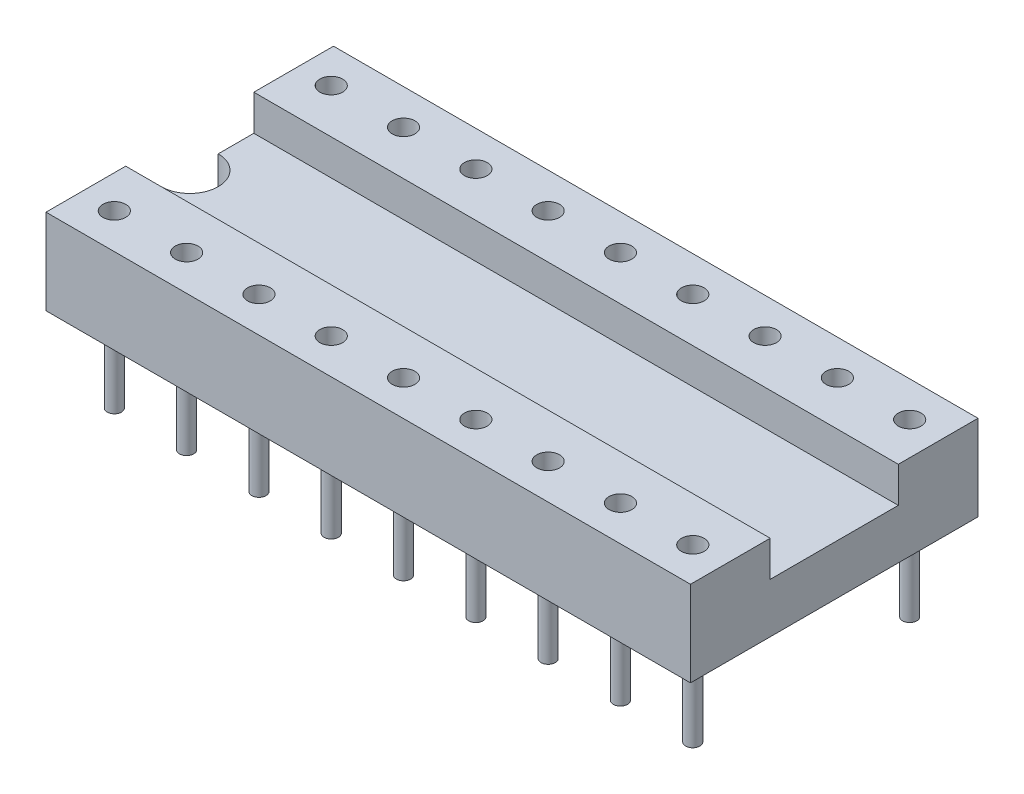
from build123d import *

# Parameters (mm, degrees)
EXTRUSION1_DEPTH        = 22.64
ENL_V_MAT_EXTRU_1_DEPTH = 24.262299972
ESQUISSE3_R             = 0.4
ENL_V_MAT_EXTRU_2_DEPTH = 2.5
ESQUISSE5_R             = 0.25
EXTRUSION2_DEPTH        = 3


with BuildPart() as part:
    # Esquisse1 → Extrusion1 (new body)
    with BuildSketch(Plane(origin=(0, 0, 0), x_dir=(0, 0, -1), z_dir=(1, 0, 0))):
        Polygon((-2.25, 1.75), (-2.25, 3), (-5.05, 3), (-5.05, 0), (5.05, 0), (5.05, 3), (2.25, 3), (2.25, 1.75), align=None)
    extrude(amount=EXTRUSION1_DEPTH)

    # Esquisse2 → Enl_v. mat.-Extru.1 (cut, through all)
    with BuildSketch(Plane(origin=(0, 1.75, 0), x_dir=(-1, 0, 0), z_dir=(0, 1, 0))):
        with BuildLine():
            Line((0, -1), (0, 1))
            ThreePointArc((0, 1), (-1, 0), (0, -1))
        make_face()
    extrude(amount=-ENL_V_MAT_EXTRU_1_DEPTH, mode=Mode.SUBTRACT)

    # Esquisse3 → Enl_v. mat.-Extru.2 (cut)
    with BuildSketch(Plane(origin=(0, 3, 0), x_dir=(-1, 0, 0), z_dir=(0, 1, 0))):
        with Locations(Location((-1.16, 3.81, 0), (0, 0, 90))):
            Circle(ESQUISSE3_R)
        with Locations(Location((-1.16, -3.81, 0), (0, 0, 270))):
            Circle(ESQUISSE3_R)
        with Locations(Location((-3.7, 3.81, 0), (0, 0, 90))):
            Circle(ESQUISSE3_R)
        with Locations(Location((-3.7, -3.81, 0), (0, 0, 270))):
            Circle(ESQUISSE3_R)
        with Locations(Location((-6.24, 3.81, 0), (0, 0, 90))):
            Circle(ESQUISSE3_R)
        with Locations(Location((-6.24, -3.81, 0), (0, 0, 270))):
            Circle(ESQUISSE3_R)
        with Locations(Location((-8.78, 3.81, 0), (0, 0, 90))):
            Circle(ESQUISSE3_R)
        with Locations(Location((-8.78, -3.81, 0), (0, 0, 270))):
            Circle(ESQUISSE3_R)
        with Locations(Location((-11.32, 3.81, 0), (0, 0, 90))):
            Circle(ESQUISSE3_R)
        with Locations(Location((-11.32, -3.81, 0), (0, 0, 270))):
            Circle(ESQUISSE3_R)
        with Locations(Location((-13.86, 3.81, 0), (0, 0, 90))):
            Circle(ESQUISSE3_R)
        with Locations(Location((-13.86, -3.81, 0), (0, 0, 270))):
            Circle(ESQUISSE3_R)
        with Locations(Location((-16.4, 3.81, 0), (0, 0, 90))):
            Circle(ESQUISSE3_R)
        with Locations(Location((-16.4, -3.81, 0), (0, 0, 270))):
            Circle(ESQUISSE3_R)
        with Locations(Location((-18.94, 3.81, 0), (0, 0, 90))):
            Circle(ESQUISSE3_R)
        with Locations(Location((-18.94, -3.81, 0), (0, 0, 270))):
            Circle(ESQUISSE3_R)
        with Locations(Location((-21.48, 3.81, 0), (0, 0, 90))):
            Circle(ESQUISSE3_R)
        with Locations(Location((-21.48, -3.81, 0), (0, 0, 270))):
            Circle(ESQUISSE3_R)
    extrude(amount=-ENL_V_MAT_EXTRU_2_DEPTH, mode=Mode.SUBTRACT)

    # Esquisse5 → Extrusion2 (add)
    with BuildSketch(Plane.XZ):
        with Locations(Location((1.16, 3.81, 0), (0, 0, 90))):
            Circle(ESQUISSE5_R)
        with Locations(Location((1.16, -3.81, 0), (0, 0, 90))):
            Circle(ESQUISSE5_R)
        with Locations(Location((3.7, -3.81, 0), (0, 0, 90))):
            Circle(ESQUISSE5_R)
        with Locations(Location((3.7, 3.81, 0), (0, 0, 90))):
            Circle(ESQUISSE5_R)
        with Locations(Location((6.24, -3.81, 0), (0, 0, 90))):
            Circle(ESQUISSE5_R)
        with Locations(Location((6.24, 3.81, 0), (0, 0, 90))):
            Circle(ESQUISSE5_R)
        with Locations(Location((8.78, -3.81, 0), (0, 0, 90))):
            Circle(ESQUISSE5_R)
        with Locations(Location((8.78, 3.81, 0), (0, 0, 90))):
            Circle(ESQUISSE5_R)
        with Locations(Location((11.32, -3.81, 0), (0, 0, 90))):
            Circle(ESQUISSE5_R)
        with Locations(Location((11.32, 3.81, 0), (0, 0, 90))):
            Circle(ESQUISSE5_R)
        with Locations(Location((13.86, -3.81, 0), (0, 0, 90))):
            Circle(ESQUISSE5_R)
        with Locations(Location((13.86, 3.81, 0), (0, 0, 90))):
            Circle(ESQUISSE5_R)
        with Locations(Location((16.4, -3.81, 0), (0, 0, 90))):
            Circle(ESQUISSE5_R)
        with Locations(Location((16.4, 3.81, 0), (0, 0, 90))):
            Circle(ESQUISSE5_R)
        with Locations(Location((18.94, -3.81, 0), (0, 0, 90))):
            Circle(ESQUISSE5_R)
        with Locations(Location((18.94, 3.81, 0), (0, 0, 90))):
            Circle(ESQUISSE5_R)
        with Locations(Location((21.48, -3.81, 0), (0, 0, 90))):
            Circle(ESQUISSE5_R)
        with Locations(Location((21.48, 3.81, 0), (0, 0, 90))):
            Circle(ESQUISSE5_R)
    extrude(amount=EXTRUSION2_DEPTH)


solid = part.part
